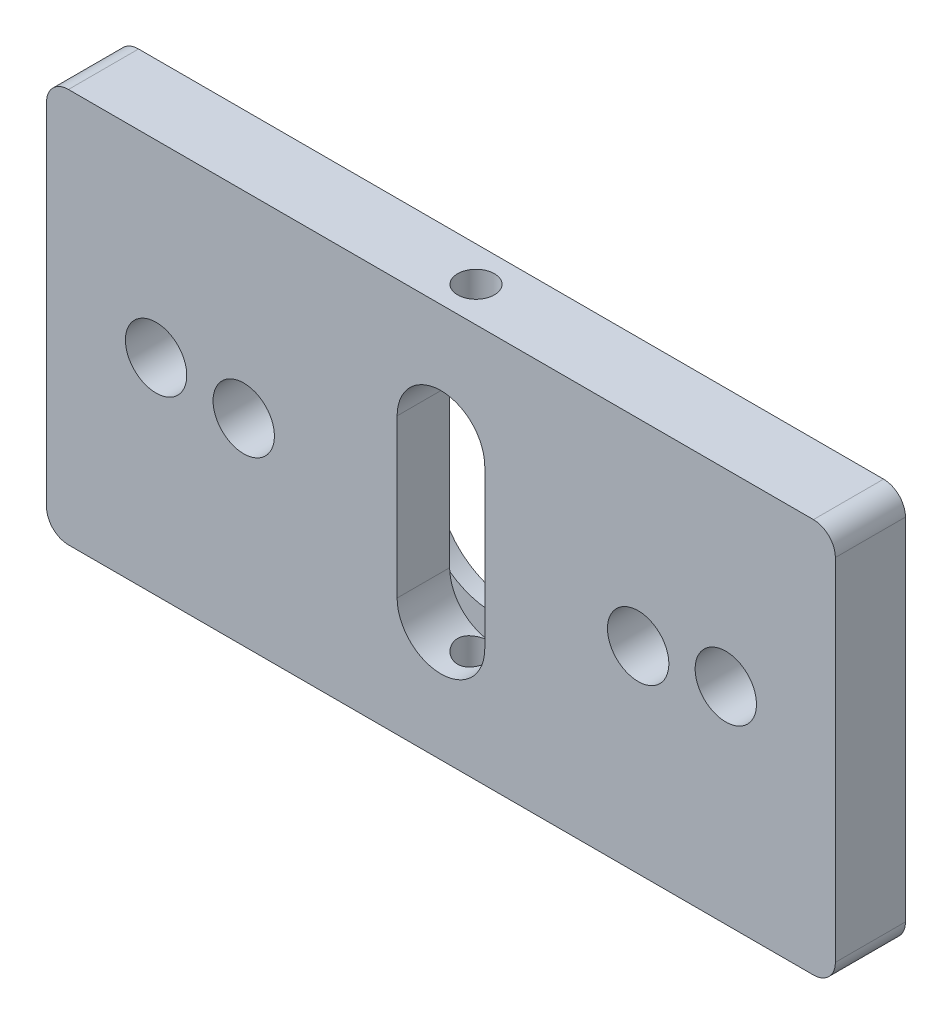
ISO-10303-21;
HEADER;
FILE_DESCRIPTION(('STEP AP214'),'2;1');
FILE_NAME('part.step','',(''),(''),'','','');
FILE_SCHEMA(('AUTOMOTIVE_DESIGN { 1 0 10303 214 1 1 1 1 }'));
ENDSEC;
DATA;
#1=APPLICATION_CONTEXT('core data for automotive mechanical design processes');
#2=APPLICATION_PROTOCOL_DEFINITION('international standard','automotive_design',2000,#1);
#3=PRODUCT_CONTEXT('',#1,'mechanical');
#4=PRODUCT('Part','Part','',(#3));
#5=PRODUCT_RELATED_PRODUCT_CATEGORY('part','',(#4));
#6=PRODUCT_DEFINITION_FORMATION('','',#4);
#7=PRODUCT_DEFINITION_CONTEXT('part definition',#1,'design');
#8=PRODUCT_DEFINITION('design','',#6,#7);
#9=PRODUCT_DEFINITION_SHAPE('','',#8);
#10=(LENGTH_UNIT() NAMED_UNIT(*) SI_UNIT(.MILLI.,.METRE.));
#11=(NAMED_UNIT(*) PLANE_ANGLE_UNIT() SI_UNIT($,.RADIAN.));
#12=(NAMED_UNIT(*) SI_UNIT($,.STERADIAN.) SOLID_ANGLE_UNIT());
#13=UNCERTAINTY_MEASURE_WITH_UNIT(LENGTH_MEASURE(1.E-05),#10,'distance_accuracy_value','');
#14=(GEOMETRIC_REPRESENTATION_CONTEXT(3) GLOBAL_UNCERTAINTY_ASSIGNED_CONTEXT((#13)) GLOBAL_UNIT_ASSIGNED_CONTEXT((#10,
#11,#12)) REPRESENTATION_CONTEXT('',''));
#15=CARTESIAN_POINT('',(0.,0.,0.));
#16=DIRECTION('',(0.,0.,1.));
#17=DIRECTION('',(1.,0.,0.));
#18=AXIS2_PLACEMENT_3D('',#15,#16,#17);
#19=CARTESIAN_POINT('',(0.,0.,0.));
#20=DIRECTION('',(0.,0.,1.));
#21=DIRECTION('',(1.,0.,0.));
#22=AXIS2_PLACEMENT_3D('',#19,#20,#21);
#23=PLANE('',#22);
#24=CARTESIAN_POINT('',(-22.5,0.,0.));
#25=DIRECTION('',(0.,0.,-1.));
#26=DIRECTION('',(-1.,0.,0.));
#27=AXIS2_PLACEMENT_3D('',#24,#25,#26);
#28=CIRCLE('',#27,3.49999999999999);
#29=CARTESIAN_POINT('',(-26.,0.,0.));
#30=VERTEX_POINT('',#29);
#31=EDGE_CURVE('E475',#30,#30,#28,.T.);
#32=ORIENTED_EDGE('',*,*,#31,.F.);
#33=EDGE_LOOP('',(#32));
#34=FACE_BOUND('',#33,.T.);
#35=CARTESIAN_POINT('',(32.5,1.,0.));
#36=DIRECTION('',(0.,0.,-1.));
#37=DIRECTION('',(-1.,0.,0.));
#38=AXIS2_PLACEMENT_3D('',#35,#36,#37);
#39=CIRCLE('',#38,3.49999999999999);
#40=CARTESIAN_POINT('',(29.,1.,0.));
#41=VERTEX_POINT('',#40);
#42=EDGE_CURVE('E463',#41,#41,#39,.T.);
#43=ORIENTED_EDGE('',*,*,#42,.F.);
#44=EDGE_LOOP('',(#43));
#45=FACE_BOUND('',#44,.T.);
#46=CARTESIAN_POINT('',(0.,-2.5,0.));
#47=DIRECTION('',(0.,0.,1.));
#48=DIRECTION('',(1.,0.,0.));
#49=AXIS2_PLACEMENT_3D('',#46,#47,#48);
#50=CIRCLE('',#49,8.5);
#51=CARTESIAN_POINT('',(8.5,-2.5,0.));
#52=VERTEX_POINT('',#51);
#53=CARTESIAN_POINT('',(-8.5,-2.5,0.));
#54=VERTEX_POINT('',#53);
#55=EDGE_CURVE('E249',#52,#54,#50,.F.);
#56=ORIENTED_EDGE('',*,*,#55,.F.);
#57=DIRECTION('',(0.,1.,0.));
#58=VECTOR('',#57,1.);
#59=CARTESIAN_POINT('',(8.5,0.,0.));
#60=LINE('',#59,#58);
#61=CARTESIAN_POINT('',(8.5,2.5,0.));
#62=VERTEX_POINT('',#61);
#63=EDGE_CURVE('E251',#62,#52,#60,.F.);
#64=ORIENTED_EDGE('',*,*,#63,.F.);
#65=CARTESIAN_POINT('',(0.,2.5,0.));
#66=DIRECTION('',(0.,0.,1.));
#67=DIRECTION('',(1.,0.,0.));
#68=AXIS2_PLACEMENT_3D('',#65,#66,#67);
#69=CIRCLE('',#68,8.5);
#70=CARTESIAN_POINT('',(-8.5,2.5,0.));
#71=VERTEX_POINT('',#70);
#72=EDGE_CURVE('E252',#71,#62,#69,.F.);
#73=ORIENTED_EDGE('',*,*,#72,.F.);
#74=DIRECTION('',(0.,1.,0.));
#75=VECTOR('',#74,1.);
#76=CARTESIAN_POINT('',(-8.5,0.,0.));
#77=LINE('',#76,#75);
#78=EDGE_CURVE('E248',#54,#71,#77,.T.);
#79=ORIENTED_EDGE('',*,*,#78,.F.);
#80=EDGE_LOOP('',(#56,#64,#73,#79));
#81=FACE_BOUND('',#80,.T.);
#82=DIRECTION('',(0.,1.,0.));
#83=VECTOR('',#82,1.);
#84=CARTESIAN_POINT('',(-45.,-22.5,0.));
#85=LINE('',#84,#83);
#86=CARTESIAN_POINT('',(-45.,20.,0.));
#87=VERTEX_POINT('',#86);
#88=CARTESIAN_POINT('',(-45.,-20.,0.));
#89=VERTEX_POINT('',#88);
#90=EDGE_CURVE('E376',#87,#89,#85,.F.);
#91=ORIENTED_EDGE('',*,*,#90,.F.);
#92=CARTESIAN_POINT('',(-42.5,20.,0.));
#93=DIRECTION('',(0.,0.,1.));
#94=DIRECTION('',(1.,0.,0.));
#95=AXIS2_PLACEMENT_3D('',#92,#93,#94);
#96=CIRCLE('',#95,2.5);
#97=CARTESIAN_POINT('',(-42.5,22.5,0.));
#98=VERTEX_POINT('',#97);
#99=EDGE_CURVE('E233',#98,#87,#96,.T.);
#100=ORIENTED_EDGE('',*,*,#99,.F.);
#101=DIRECTION('',(1.,0.,0.));
#102=VECTOR('',#101,1.);
#103=CARTESIAN_POINT('',(-45.,22.5,0.));
#104=LINE('',#103,#102);
#105=CARTESIAN_POINT('',(42.5,22.5,0.));
#106=VERTEX_POINT('',#105);
#107=EDGE_CURVE('E397',#106,#98,#104,.F.);
#108=ORIENTED_EDGE('',*,*,#107,.F.);
#109=CARTESIAN_POINT('',(42.5,20.,0.));
#110=DIRECTION('',(0.,0.,1.));
#111=DIRECTION('',(1.,0.,0.));
#112=AXIS2_PLACEMENT_3D('',#109,#110,#111);
#113=CIRCLE('',#112,2.5);
#114=CARTESIAN_POINT('',(45.,20.,0.));
#115=VERTEX_POINT('',#114);
#116=EDGE_CURVE('E237',#115,#106,#113,.T.);
#117=ORIENTED_EDGE('',*,*,#116,.F.);
#118=DIRECTION('',(0.,1.,0.));
#119=VECTOR('',#118,1.);
#120=CARTESIAN_POINT('',(45.,22.5,0.));
#121=LINE('',#120,#119);
#122=CARTESIAN_POINT('',(45.,-20.,0.));
#123=VERTEX_POINT('',#122);
#124=EDGE_CURVE('E402',#123,#115,#121,.T.);
#125=ORIENTED_EDGE('',*,*,#124,.F.);
#126=CARTESIAN_POINT('',(42.5,-20.,0.));
#127=DIRECTION('',(0.,0.,1.));
#128=DIRECTION('',(1.,0.,0.));
#129=AXIS2_PLACEMENT_3D('',#126,#127,#128);
#130=CIRCLE('',#129,2.5);
#131=CARTESIAN_POINT('',(42.5,-22.5,0.));
#132=VERTEX_POINT('',#131);
#133=EDGE_CURVE('E241',#132,#123,#130,.T.);
#134=ORIENTED_EDGE('',*,*,#133,.F.);
#135=DIRECTION('',(1.,0.,0.));
#136=VECTOR('',#135,1.);
#137=CARTESIAN_POINT('',(45.,-22.5,0.));
#138=LINE('',#137,#136);
#139=CARTESIAN_POINT('',(-42.5,-22.5,0.));
#140=VERTEX_POINT('',#139);
#141=EDGE_CURVE('E407',#140,#132,#138,.T.);
#142=ORIENTED_EDGE('',*,*,#141,.F.);
#143=CARTESIAN_POINT('',(-42.5,-20.,0.));
#144=DIRECTION('',(0.,0.,1.));
#145=DIRECTION('',(1.,0.,0.));
#146=AXIS2_PLACEMENT_3D('',#143,#144,#145);
#147=CIRCLE('',#146,2.5);
#148=EDGE_CURVE('E245',#89,#140,#147,.T.);
#149=ORIENTED_EDGE('',*,*,#148,.F.);
#150=EDGE_LOOP('',(#91,#100,#108,#117,#125,#134,#142,#149));
#151=FACE_BOUND('',#150,.T.);
#152=CARTESIAN_POINT('',(22.5,0.,0.));
#153=DIRECTION('',(0.,0.,-1.));
#154=DIRECTION('',(-1.,0.,0.));
#155=AXIS2_PLACEMENT_3D('',#152,#153,#154);
#156=CIRCLE('',#155,3.49999999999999);
#157=CARTESIAN_POINT('',(19.,0.,0.));
#158=VERTEX_POINT('',#157);
#159=EDGE_CURVE('E469',#158,#158,#156,.T.);
#160=ORIENTED_EDGE('',*,*,#159,.F.);
#161=EDGE_LOOP('',(#160));
#162=FACE_BOUND('',#161,.T.);
#163=CARTESIAN_POINT('',(-32.5,0.999999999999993,0.));
#164=DIRECTION('',(0.,0.,-1.));
#165=DIRECTION('',(-1.,0.,0.));
#166=AXIS2_PLACEMENT_3D('',#163,#164,#165);
#167=CIRCLE('',#166,3.49999999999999);
#168=CARTESIAN_POINT('',(-36.,0.999999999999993,0.));
#169=VERTEX_POINT('',#168);
#170=EDGE_CURVE('E309',#169,#169,#167,.T.);
#171=ORIENTED_EDGE('',*,*,#170,.F.);
#172=EDGE_LOOP('',(#171));
#173=FACE_BOUND('',#172,.T.);
#174=ADVANCED_FACE('F40',(#34,#45,#81,#151,#162,#173),#23,.F.);
#175=CARTESIAN_POINT('',(0.,0.,8.));
#176=DIRECTION('',(0.,0.,1.));
#177=DIRECTION('',(1.,0.,0.));
#178=AXIS2_PLACEMENT_3D('',#175,#176,#177);
#179=PLANE('',#178);
#180=CARTESIAN_POINT('',(-22.5,0.,8.));
#181=DIRECTION('',(0.,0.,-1.));
#182=DIRECTION('',(-1.,0.,0.));
#183=AXIS2_PLACEMENT_3D('',#180,#181,#182);
#184=CIRCLE('',#183,3.5);
#185=CARTESIAN_POINT('',(-26.,0.,8.));
#186=VERTEX_POINT('',#185);
#187=EDGE_CURVE('E472',#186,#186,#184,.T.);
#188=ORIENTED_EDGE('',*,*,#187,.T.);
#189=EDGE_LOOP('',(#188));
#190=FACE_BOUND('',#189,.T.);
#191=CARTESIAN_POINT('',(32.5,1.,8.));
#192=DIRECTION('',(0.,0.,-1.));
#193=DIRECTION('',(-1.,0.,0.));
#194=AXIS2_PLACEMENT_3D('',#191,#192,#193);
#195=CIRCLE('',#194,3.5);
#196=CARTESIAN_POINT('',(29.,1.,8.));
#197=VERTEX_POINT('',#196);
#198=EDGE_CURVE('E429',#197,#197,#195,.T.);
#199=ORIENTED_EDGE('',*,*,#198,.T.);
#200=EDGE_LOOP('',(#199));
#201=FACE_BOUND('',#200,.T.);
#202=DIRECTION('',(0.,1.,0.));
#203=VECTOR('',#202,1.);
#204=CARTESIAN_POINT('',(-5.,0.,8.));
#205=LINE('',#204,#203);
#206=CARTESIAN_POINT('',(-5.,-9.,8.));
#207=VERTEX_POINT('',#206);
#208=CARTESIAN_POINT('',(-5.,9.,8.));
#209=VERTEX_POINT('',#208);
#210=EDGE_CURVE('E431',#207,#209,#205,.T.);
#211=ORIENTED_EDGE('',*,*,#210,.T.);
#212=CARTESIAN_POINT('',(0.,9.,8.));
#213=DIRECTION('',(0.,0.,-1.));
#214=DIRECTION('',(-1.,0.,0.));
#215=AXIS2_PLACEMENT_3D('',#212,#213,#214);
#216=CIRCLE('',#215,5.);
#217=CARTESIAN_POINT('',(5.,9.,8.));
#218=VERTEX_POINT('',#217);
#219=EDGE_CURVE('E286',#209,#218,#216,.T.);
#220=ORIENTED_EDGE('',*,*,#219,.T.);
#221=DIRECTION('',(0.,1.,0.));
#222=VECTOR('',#221,1.);
#223=CARTESIAN_POINT('',(5.,0.,8.));
#224=LINE('',#223,#222);
#225=CARTESIAN_POINT('',(5.,-9.,8.));
#226=VERTEX_POINT('',#225);
#227=EDGE_CURVE('E381',#218,#226,#224,.F.);
#228=ORIENTED_EDGE('',*,*,#227,.T.);
#229=CARTESIAN_POINT('',(0.,-9.,8.));
#230=DIRECTION('',(0.,0.,-1.));
#231=DIRECTION('',(-1.,0.,0.));
#232=AXIS2_PLACEMENT_3D('',#229,#230,#231);
#233=CIRCLE('',#232,5.);
#234=EDGE_CURVE('E432',#226,#207,#233,.T.);
#235=ORIENTED_EDGE('',*,*,#234,.T.);
#236=EDGE_LOOP('',(#211,#220,#228,#235));
#237=FACE_BOUND('',#236,.T.);
#238=CARTESIAN_POINT('',(-42.5,20.,8.));
#239=DIRECTION('',(0.,0.,1.));
#240=DIRECTION('',(1.,0.,0.));
#241=AXIS2_PLACEMENT_3D('',#238,#239,#240);
#242=CIRCLE('',#241,2.5);
#243=CARTESIAN_POINT('',(-42.5,22.5,8.));
#244=VERTEX_POINT('',#243);
#245=CARTESIAN_POINT('',(-45.,20.,8.));
#246=VERTEX_POINT('',#245);
#247=EDGE_CURVE('E435',#244,#246,#242,.T.);
#248=ORIENTED_EDGE('',*,*,#247,.T.);
#249=DIRECTION('',(0.,1.,0.));
#250=VECTOR('',#249,1.);
#251=CARTESIAN_POINT('',(-45.,0.,8.));
#252=LINE('',#251,#250);
#253=CARTESIAN_POINT('',(-45.,-20.,8.));
#254=VERTEX_POINT('',#253);
#255=EDGE_CURVE('E438',#246,#254,#252,.F.);
#256=ORIENTED_EDGE('',*,*,#255,.T.);
#257=CARTESIAN_POINT('',(-42.5,-20.,8.));
#258=DIRECTION('',(0.,0.,1.));
#259=DIRECTION('',(1.,0.,0.));
#260=AXIS2_PLACEMENT_3D('',#257,#258,#259);
#261=CIRCLE('',#260,2.5);
#262=CARTESIAN_POINT('',(-42.5,-22.5,8.));
#263=VERTEX_POINT('',#262);
#264=EDGE_CURVE('E385',#254,#263,#261,.T.);
#265=ORIENTED_EDGE('',*,*,#264,.T.);
#266=DIRECTION('',(1.,0.,0.));
#267=VECTOR('',#266,1.);
#268=CARTESIAN_POINT('',(0.,-22.5,8.));
#269=LINE('',#268,#267);
#270=CARTESIAN_POINT('',(42.5,-22.5,8.));
#271=VERTEX_POINT('',#270);
#272=EDGE_CURVE('E446',#263,#271,#269,.T.);
#273=ORIENTED_EDGE('',*,*,#272,.T.);
#274=CARTESIAN_POINT('',(42.5,-20.,8.));
#275=DIRECTION('',(0.,0.,1.));
#276=DIRECTION('',(1.,0.,0.));
#277=AXIS2_PLACEMENT_3D('',#274,#275,#276);
#278=CIRCLE('',#277,2.5);
#279=CARTESIAN_POINT('',(45.,-20.,8.));
#280=VERTEX_POINT('',#279);
#281=EDGE_CURVE('E444',#271,#280,#278,.T.);
#282=ORIENTED_EDGE('',*,*,#281,.T.);
#283=DIRECTION('',(0.,1.,0.));
#284=VECTOR('',#283,1.);
#285=CARTESIAN_POINT('',(45.,0.,8.));
#286=LINE('',#285,#284);
#287=CARTESIAN_POINT('',(45.,20.,8.));
#288=VERTEX_POINT('',#287);
#289=EDGE_CURVE('E443',#280,#288,#286,.T.);
#290=ORIENTED_EDGE('',*,*,#289,.T.);
#291=CARTESIAN_POINT('',(42.5,20.,8.));
#292=DIRECTION('',(0.,0.,1.));
#293=DIRECTION('',(1.,0.,0.));
#294=AXIS2_PLACEMENT_3D('',#291,#292,#293);
#295=CIRCLE('',#294,2.5);
#296=CARTESIAN_POINT('',(42.5,22.5,8.));
#297=VERTEX_POINT('',#296);
#298=EDGE_CURVE('E440',#288,#297,#295,.T.);
#299=ORIENTED_EDGE('',*,*,#298,.T.);
#300=DIRECTION('',(1.,0.,0.));
#301=VECTOR('',#300,1.);
#302=CARTESIAN_POINT('',(0.,22.5,8.));
#303=LINE('',#302,#301);
#304=EDGE_CURVE('E439',#297,#244,#303,.F.);
#305=ORIENTED_EDGE('',*,*,#304,.T.);
#306=EDGE_LOOP('',(#248,#256,#265,#273,#282,#290,#299,#305));
#307=FACE_BOUND('',#306,.T.);
#308=CARTESIAN_POINT('',(22.5,0.,8.));
#309=DIRECTION('',(0.,0.,-1.));
#310=DIRECTION('',(-1.,0.,0.));
#311=AXIS2_PLACEMENT_3D('',#308,#309,#310);
#312=CIRCLE('',#311,3.5);
#313=CARTESIAN_POINT('',(19.,0.,8.));
#314=VERTEX_POINT('',#313);
#315=EDGE_CURVE('E466',#314,#314,#312,.T.);
#316=ORIENTED_EDGE('',*,*,#315,.T.);
#317=EDGE_LOOP('',(#316));
#318=FACE_BOUND('',#317,.T.);
#319=CARTESIAN_POINT('',(-32.5,0.999999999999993,8.));
#320=DIRECTION('',(0.,0.,-1.));
#321=DIRECTION('',(-1.,0.,0.));
#322=AXIS2_PLACEMENT_3D('',#319,#320,#321);
#323=CIRCLE('',#322,3.5);
#324=CARTESIAN_POINT('',(-36.,0.999999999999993,8.));
#325=VERTEX_POINT('',#324);
#326=EDGE_CURVE('E477',#325,#325,#323,.T.);
#327=ORIENTED_EDGE('',*,*,#326,.T.);
#328=EDGE_LOOP('',(#327));
#329=FACE_BOUND('',#328,.T.);
#330=ADVANCED_FACE('F326',(#190,#201,#237,#307,#318,#329),#179,.T.);
#331=CARTESIAN_POINT('',(0.,2.5,0.));
#332=DIRECTION('',(0.,0.,1.));
#333=DIRECTION('',(1.,0.,0.));
#334=AXIS2_PLACEMENT_3D('',#331,#332,#333);
#335=CYLINDRICAL_SURFACE('',#334,8.5);
#336=CARTESIAN_POINT('',(0.,2.5,2.));
#337=DIRECTION('',(0.,0.,1.));
#338=DIRECTION('',(1.,0.,0.));
#339=AXIS2_PLACEMENT_3D('',#336,#337,#338);
#340=CIRCLE('',#339,8.5);
#341=CARTESIAN_POINT('',(0.640312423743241,10.9758480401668,2.));
#342=VERTEX_POINT('',#341);
#343=CARTESIAN_POINT('',(4.98518515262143,9.38461538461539,2.));
#344=VERTEX_POINT('',#343);
#345=EDGE_CURVE('E254',#342,#344,#340,.F.);
#346=ORIENTED_EDGE('',*,*,#345,.F.);
#347=CARTESIAN_POINT('',(0.640312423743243,10.9758480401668,2.));
#348=CARTESIAN_POINT('',(0.58490483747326,10.9800365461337,1.98226057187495));
#349=CARTESIAN_POINT('',(0.5287496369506,10.9837289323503,1.96682265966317));
#350=CARTESIAN_POINT('',(0.415290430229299,10.9900387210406,1.94064898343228));
#351=CARTESIAN_POINT('',(0.357986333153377,10.992656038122,1.92991359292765));
#352=CARTESIAN_POINT('',(0.188006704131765,10.9986600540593,1.90536460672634));
#353=CARTESIAN_POINT('',(0.0742256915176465,11.0004328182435,1.89824420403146));
#354=CARTESIAN_POINT('',(-0.1401411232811,10.9994439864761,1.90225406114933));
#355=CARTESIAN_POINT('',(-0.240772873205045,10.9971695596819,1.91142329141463));
#356=CARTESIAN_POINT('',(-0.390986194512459,10.991156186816,1.93607348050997));
#357=CARTESIAN_POINT('',(-0.441527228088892,10.9886726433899,1.94629454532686));
#358=CARTESIAN_POINT('',(-0.54168004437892,10.982871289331,1.97040979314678));
#359=CARTESIAN_POINT('',(-0.59129176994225,10.9795534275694,1.98430420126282));
#360=CARTESIAN_POINT('',(-0.640312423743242,10.9758480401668,2.));
#361=B_SPLINE_CURVE_WITH_KNOTS('',3,(#347,#348,#349,#350,#351,#352,#353,#354,#355,#356,#357,
#358,#359,#360),.UNSPECIFIED.,.F.,.F.,(4,2,2,2,2,2,4),(0.,0.174881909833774,0.349777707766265,
0.690103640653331,0.992184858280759,1.14692620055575,1.30167702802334),.UNSPECIFIED.);
#362=CARTESIAN_POINT('',(-0.64031242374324,10.9758480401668,2.));
#363=VERTEX_POINT('',#362);
#364=EDGE_CURVE('E206',#342,#363,#361,.T.);
#365=ORIENTED_EDGE('',*,*,#364,.T.);
#366=CARTESIAN_POINT('',(0.,2.5,2.));
#367=DIRECTION('',(0.,0.,1.));
#368=DIRECTION('',(1.,0.,0.));
#369=AXIS2_PLACEMENT_3D('',#366,#367,#368);
#370=CIRCLE('',#369,8.5);
#371=CARTESIAN_POINT('',(-4.98518515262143,9.38461538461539,2.));
#372=VERTEX_POINT('',#371);
#373=EDGE_CURVE('E205',#372,#363,#370,.F.);
#374=ORIENTED_EDGE('',*,*,#373,.F.);
#375=CARTESIAN_POINT('',(0.,2.5,2.));
#376=DIRECTION('',(0.,0.,1.));
#377=DIRECTION('',(1.,0.,0.));
#378=AXIS2_PLACEMENT_3D('',#375,#376,#377);
#379=CIRCLE('',#378,8.5);
#380=CARTESIAN_POINT('',(-8.5,2.5,2.));
#381=VERTEX_POINT('',#380);
#382=EDGE_CURVE('E261',#372,#381,#379,.T.);
#383=ORIENTED_EDGE('',*,*,#382,.T.);
#384=DIRECTION('',(0.,0.,1.));
#385=VECTOR('',#384,1.);
#386=CARTESIAN_POINT('',(-8.5,2.5,0.));
#387=LINE('',#386,#385);
#388=EDGE_CURVE('E423',#381,#71,#387,.F.);
#389=ORIENTED_EDGE('',*,*,#388,.T.);
#390=ORIENTED_EDGE('',*,*,#72,.T.);
#391=DIRECTION('',(0.,0.,-1.));
#392=VECTOR('',#391,1.);
#393=CARTESIAN_POINT('',(8.5,2.5,0.));
#394=LINE('',#393,#392);
#395=CARTESIAN_POINT('',(8.5,2.5,2.));
#396=VERTEX_POINT('',#395);
#397=EDGE_CURVE('E427',#62,#396,#394,.F.);
#398=ORIENTED_EDGE('',*,*,#397,.T.);
#399=CARTESIAN_POINT('',(0.,2.5,2.));
#400=DIRECTION('',(0.,0.,1.));
#401=DIRECTION('',(1.,0.,0.));
#402=AXIS2_PLACEMENT_3D('',#399,#400,#401);
#403=CIRCLE('',#402,8.5);
#404=EDGE_CURVE('E274',#396,#344,#403,.T.);
#405=ORIENTED_EDGE('',*,*,#404,.T.);
#406=EDGE_LOOP('',(#346,#365,#374,#383,#389,#390,#398,#405));
#407=FACE_BOUND('',#406,.T.);
#408=ADVANCED_FACE('F42',(#407),#335,.F.);
#409=CARTESIAN_POINT('',(8.5,2.5,0.));
#410=DIRECTION('',(1.,0.,0.));
#411=DIRECTION('',(0.,0.,-1.));
#412=AXIS2_PLACEMENT_3D('',#409,#410,#411);
#413=PLANE('',#412);
#414=ORIENTED_EDGE('',*,*,#397,.F.);
#415=ORIENTED_EDGE('',*,*,#63,.T.);
#416=DIRECTION('',(0.,0.,1.));
#417=VECTOR('',#416,1.);
#418=CARTESIAN_POINT('',(8.5,-2.5,0.));
#419=LINE('',#418,#417);
#420=CARTESIAN_POINT('',(8.5,-2.5,2.));
#421=VERTEX_POINT('',#420);
#422=EDGE_CURVE('E425',#52,#421,#419,.T.);
#423=ORIENTED_EDGE('',*,*,#422,.T.);
#424=DIRECTION('',(0.,1.,0.));
#425=VECTOR('',#424,1.);
#426=CARTESIAN_POINT('',(8.5,0.,2.));
#427=LINE('',#426,#425);
#428=EDGE_CURVE('E277',#421,#396,#427,.T.);
#429=ORIENTED_EDGE('',*,*,#428,.T.);
#430=EDGE_LOOP('',(#414,#415,#423,#429));
#431=FACE_BOUND('',#430,.T.);
#432=ADVANCED_FACE('F318',(#431),#413,.F.);
#433=CARTESIAN_POINT('',(0.,-2.5,0.));
#434=DIRECTION('',(0.,0.,1.));
#435=DIRECTION('',(1.,0.,0.));
#436=AXIS2_PLACEMENT_3D('',#433,#434,#435);
#437=CYLINDRICAL_SURFACE('',#436,8.5);
#438=CARTESIAN_POINT('',(0.,-2.5,2.));
#439=DIRECTION('',(0.,0.,1.));
#440=DIRECTION('',(1.,0.,0.));
#441=AXIS2_PLACEMENT_3D('',#438,#439,#440);
#442=CIRCLE('',#441,8.5);
#443=CARTESIAN_POINT('',(-0.640312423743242,-10.9758480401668,2.));
#444=VERTEX_POINT('',#443);
#445=CARTESIAN_POINT('',(-4.98518515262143,-9.38461538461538,2.));
#446=VERTEX_POINT('',#445);
#447=EDGE_CURVE('E264',#444,#446,#442,.F.);
#448=ORIENTED_EDGE('',*,*,#447,.F.);
#449=CARTESIAN_POINT('',(-0.640312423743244,-10.9758480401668,2.));
#450=CARTESIAN_POINT('',(-0.584904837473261,-10.9800365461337,1.98226057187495));
#451=CARTESIAN_POINT('',(-0.528749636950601,-10.9837289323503,1.96682265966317));
#452=CARTESIAN_POINT('',(-0.4152904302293,-10.9900387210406,1.94064898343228));
#453=CARTESIAN_POINT('',(-0.357986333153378,-10.992656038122,1.92991359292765));
#454=CARTESIAN_POINT('',(-0.188006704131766,-10.9986600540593,1.90536460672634));
#455=CARTESIAN_POINT('',(-0.0742256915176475,-11.0004328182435,1.89824420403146));
#456=CARTESIAN_POINT('',(0.140141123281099,-10.9994439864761,1.90225406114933));
#457=CARTESIAN_POINT('',(0.240772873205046,-10.9971695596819,1.91142329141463));
#458=CARTESIAN_POINT('',(0.39098619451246,-10.991156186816,1.93607348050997));
#459=CARTESIAN_POINT('',(0.441527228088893,-10.9886726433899,1.94629454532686));
#460=CARTESIAN_POINT('',(0.541680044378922,-10.982871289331,1.97040979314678));
#461=CARTESIAN_POINT('',(0.591291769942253,-10.9795534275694,1.98430420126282));
#462=CARTESIAN_POINT('',(0.640312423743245,-10.9758480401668,2.));
#463=B_SPLINE_CURVE_WITH_KNOTS('',3,(#449,#450,#451,#452,#453,#454,#455,#456,#457,#458,#459,
#460,#461,#462),.UNSPECIFIED.,.F.,.F.,(4,2,2,2,2,2,4),(0.,0.174881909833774,0.349777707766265,
0.690103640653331,0.992184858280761,1.14692620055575,1.30167702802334),.UNSPECIFIED.);
#464=CARTESIAN_POINT('',(0.640312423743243,-10.9758480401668,2.));
#465=VERTEX_POINT('',#464);
#466=EDGE_CURVE('E301',#444,#465,#463,.T.);
#467=ORIENTED_EDGE('',*,*,#466,.T.);
#468=CARTESIAN_POINT('',(0.,-2.5,2.));
#469=DIRECTION('',(0.,0.,1.));
#470=DIRECTION('',(1.,0.,0.));
#471=AXIS2_PLACEMENT_3D('',#468,#469,#470);
#472=CIRCLE('',#471,8.5);
#473=CARTESIAN_POINT('',(4.98518515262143,-9.38461538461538,2.));
#474=VERTEX_POINT('',#473);
#475=EDGE_CURVE('E266',#474,#465,#472,.F.);
#476=ORIENTED_EDGE('',*,*,#475,.F.);
#477=CARTESIAN_POINT('',(0.,-2.5,2.));
#478=DIRECTION('',(0.,0.,1.));
#479=DIRECTION('',(1.,0.,0.));
#480=AXIS2_PLACEMENT_3D('',#477,#478,#479);
#481=CIRCLE('',#480,8.5);
#482=EDGE_CURVE('E278',#474,#421,#481,.T.);
#483=ORIENTED_EDGE('',*,*,#482,.T.);
#484=ORIENTED_EDGE('',*,*,#422,.F.);
#485=ORIENTED_EDGE('',*,*,#55,.T.);
#486=DIRECTION('',(0.,0.,1.));
#487=VECTOR('',#486,1.);
#488=CARTESIAN_POINT('',(-8.5,-2.5,0.));
#489=LINE('',#488,#487);
#490=CARTESIAN_POINT('',(-8.5,-2.5,2.));
#491=VERTEX_POINT('',#490);
#492=EDGE_CURVE('E280',#54,#491,#489,.T.);
#493=ORIENTED_EDGE('',*,*,#492,.T.);
#494=CARTESIAN_POINT('',(0.,-2.5,2.));
#495=DIRECTION('',(0.,0.,1.));
#496=DIRECTION('',(1.,0.,0.));
#497=AXIS2_PLACEMENT_3D('',#494,#495,#496);
#498=CIRCLE('',#497,8.5);
#499=EDGE_CURVE('E257',#491,#446,#498,.T.);
#500=ORIENTED_EDGE('',*,*,#499,.T.);
#501=EDGE_LOOP('',(#448,#467,#476,#483,#484,#485,#493,#500));
#502=FACE_BOUND('',#501,.T.);
#503=ADVANCED_FACE('F313',(#502),#437,.F.);
#504=CARTESIAN_POINT('',(-8.5,-2.5,0.));
#505=DIRECTION('',(-1.,0.,0.));
#506=DIRECTION('',(0.,0.,1.));
#507=AXIS2_PLACEMENT_3D('',#504,#505,#506);
#508=PLANE('',#507);
#509=ORIENTED_EDGE('',*,*,#492,.F.);
#510=ORIENTED_EDGE('',*,*,#78,.T.);
#511=ORIENTED_EDGE('',*,*,#388,.F.);
#512=DIRECTION('',(0.,1.,0.));
#513=VECTOR('',#512,1.);
#514=CARTESIAN_POINT('',(-8.5,0.,2.));
#515=LINE('',#514,#513);
#516=EDGE_CURVE('E260',#381,#491,#515,.F.);
#517=ORIENTED_EDGE('',*,*,#516,.T.);
#518=EDGE_LOOP('',(#509,#510,#511,#517));
#519=FACE_BOUND('',#518,.T.);
#520=ADVANCED_FACE('F317',(#519),#508,.F.);
#521=CARTESIAN_POINT('',(0.,0.,2.));
#522=DIRECTION('',(0.,0.,1.));
#523=DIRECTION('',(1.,0.,0.));
#524=AXIS2_PLACEMENT_3D('',#521,#522,#523);
#525=PLANE('',#524);
#526=DIRECTION('',(0.,1.,0.));
#527=VECTOR('',#526,1.);
#528=CARTESIAN_POINT('',(5.,-9.,2.));
#529=LINE('',#528,#527);
#530=CARTESIAN_POINT('',(5.,-9.,2.));
#531=VERTEX_POINT('',#530);
#532=CARTESIAN_POINT('',(5.,9.,2.));
#533=VERTEX_POINT('',#532);
#534=EDGE_CURVE('E232',#531,#533,#529,.T.);
#535=ORIENTED_EDGE('',*,*,#534,.T.);
#536=CARTESIAN_POINT('',(0.,9.,2.));
#537=DIRECTION('',(0.,0.,-1.));
#538=DIRECTION('',(-1.,0.,0.));
#539=AXIS2_PLACEMENT_3D('',#536,#537,#538);
#540=CIRCLE('',#539,5.);
#541=EDGE_CURVE('E272',#344,#533,#540,.T.);
#542=ORIENTED_EDGE('',*,*,#541,.F.);
#543=ORIENTED_EDGE('',*,*,#404,.F.);
#544=ORIENTED_EDGE('',*,*,#428,.F.);
#545=ORIENTED_EDGE('',*,*,#482,.F.);
#546=CARTESIAN_POINT('',(0.,-9.,2.));
#547=DIRECTION('',(0.,0.,-1.));
#548=DIRECTION('',(-1.,0.,0.));
#549=AXIS2_PLACEMENT_3D('',#546,#547,#548);
#550=CIRCLE('',#549,5.);
#551=EDGE_CURVE('E269',#531,#474,#550,.T.);
#552=ORIENTED_EDGE('',*,*,#551,.F.);
#553=EDGE_LOOP('',(#535,#542,#543,#544,#545,#552));
#554=FACE_BOUND('',#553,.T.);
#555=ADVANCED_FACE('F360',(#554),#525,.F.);
#556=CARTESIAN_POINT('',(0.,0.,2.));
#557=DIRECTION('',(0.,0.,1.));
#558=DIRECTION('',(1.,0.,0.));
#559=AXIS2_PLACEMENT_3D('',#556,#557,#558);
#560=PLANE('',#559);
#561=DIRECTION('',(0.,-1.,0.));
#562=VECTOR('',#561,1.);
#563=CARTESIAN_POINT('',(0.640312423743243,-22.5,2.));
#564=LINE('',#563,#562);
#565=CARTESIAN_POINT('',(0.64031242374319,-13.958830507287,1.99999999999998));
#566=VERTEX_POINT('',#565);
#567=EDGE_CURVE('E310',#566,#465,#564,.F.);
#568=ORIENTED_EDGE('',*,*,#567,.F.);
#569=CARTESIAN_POINT('',(0.,-9.,2.));
#570=DIRECTION('',(0.,0.,-1.));
#571=DIRECTION('',(-1.,0.,0.));
#572=AXIS2_PLACEMENT_3D('',#569,#570,#571);
#573=CIRCLE('',#572,5.);
#574=EDGE_CURVE('E230',#566,#474,#573,.F.);
#575=ORIENTED_EDGE('',*,*,#574,.T.);
#576=ORIENTED_EDGE('',*,*,#475,.T.);
#577=EDGE_LOOP('',(#568,#575,#576));
#578=FACE_BOUND('',#577,.T.);
#579=ADVANCED_FACE('F357',(#578),#560,.T.);
#580=CARTESIAN_POINT('',(0.,0.,2.));
#581=DIRECTION('',(0.,0.,1.));
#582=DIRECTION('',(1.,0.,0.));
#583=AXIS2_PLACEMENT_3D('',#580,#581,#582);
#584=PLANE('',#583);
#585=DIRECTION('',(0.,-1.,0.));
#586=VECTOR('',#585,1.);
#587=CARTESIAN_POINT('',(-0.640312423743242,-22.5,2.));
#588=LINE('',#587,#586);
#589=CARTESIAN_POINT('',(-0.640312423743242,-13.958830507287,2.));
#590=VERTEX_POINT('',#589);
#591=EDGE_CURVE('E68',#444,#590,#588,.T.);
#592=ORIENTED_EDGE('',*,*,#591,.F.);
#593=ORIENTED_EDGE('',*,*,#447,.T.);
#594=CARTESIAN_POINT('',(0.,-9.,2.));
#595=DIRECTION('',(0.,0.,-1.));
#596=DIRECTION('',(-1.,0.,0.));
#597=AXIS2_PLACEMENT_3D('',#594,#595,#596);
#598=CIRCLE('',#597,5.);
#599=EDGE_CURVE('E223',#446,#590,#598,.F.);
#600=ORIENTED_EDGE('',*,*,#599,.T.);
#601=EDGE_LOOP('',(#592,#593,#600));
#602=FACE_BOUND('',#601,.T.);
#603=ADVANCED_FACE('F353',(#602),#584,.T.);
#604=CARTESIAN_POINT('',(0.,0.,2.));
#605=DIRECTION('',(0.,0.,1.));
#606=DIRECTION('',(1.,0.,0.));
#607=AXIS2_PLACEMENT_3D('',#604,#605,#606);
#608=PLANE('',#607);
#609=ORIENTED_EDGE('',*,*,#499,.F.);
#610=ORIENTED_EDGE('',*,*,#516,.F.);
#611=ORIENTED_EDGE('',*,*,#382,.F.);
#612=CARTESIAN_POINT('',(0.,9.,2.));
#613=DIRECTION('',(0.,0.,-1.));
#614=DIRECTION('',(-1.,0.,0.));
#615=AXIS2_PLACEMENT_3D('',#612,#613,#614);
#616=CIRCLE('',#615,5.);
#617=CARTESIAN_POINT('',(-5.,9.,2.));
#618=VERTEX_POINT('',#617);
#619=EDGE_CURVE('E210',#618,#372,#616,.T.);
#620=ORIENTED_EDGE('',*,*,#619,.F.);
#621=DIRECTION('',(0.,1.,0.));
#622=VECTOR('',#621,1.);
#623=CARTESIAN_POINT('',(-5.,9.,2.));
#624=LINE('',#623,#622);
#625=CARTESIAN_POINT('',(-5.,-9.,2.));
#626=VERTEX_POINT('',#625);
#627=EDGE_CURVE('E212',#618,#626,#624,.F.);
#628=ORIENTED_EDGE('',*,*,#627,.T.);
#629=CARTESIAN_POINT('',(0.,-9.,2.));
#630=DIRECTION('',(0.,0.,-1.));
#631=DIRECTION('',(-1.,0.,0.));
#632=AXIS2_PLACEMENT_3D('',#629,#630,#631);
#633=CIRCLE('',#632,5.);
#634=EDGE_CURVE('E226',#626,#446,#633,.F.);
#635=ORIENTED_EDGE('',*,*,#634,.T.);
#636=EDGE_LOOP('',(#609,#610,#611,#620,#628,#635));
#637=FACE_BOUND('',#636,.T.);
#638=ADVANCED_FACE('F350',(#637),#608,.F.);
#639=CARTESIAN_POINT('',(0.,0.,2.));
#640=DIRECTION('',(0.,0.,1.));
#641=DIRECTION('',(1.,0.,0.));
#642=AXIS2_PLACEMENT_3D('',#639,#640,#641);
#643=PLANE('',#642);
#644=DIRECTION('',(0.,1.,0.));
#645=VECTOR('',#644,1.);
#646=CARTESIAN_POINT('',(-0.64031242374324,22.5,2.));
#647=LINE('',#646,#645);
#648=CARTESIAN_POINT('',(-0.64031242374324,13.958830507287,2.));
#649=VERTEX_POINT('',#648);
#650=EDGE_CURVE('E193',#649,#363,#647,.F.);
#651=ORIENTED_EDGE('',*,*,#650,.F.);
#652=CARTESIAN_POINT('',(0.,9.,2.));
#653=DIRECTION('',(0.,0.,-1.));
#654=DIRECTION('',(-1.,0.,0.));
#655=AXIS2_PLACEMENT_3D('',#652,#653,#654);
#656=CIRCLE('',#655,5.);
#657=EDGE_CURVE('E202',#649,#372,#656,.F.);
#658=ORIENTED_EDGE('',*,*,#657,.T.);
#659=ORIENTED_EDGE('',*,*,#373,.T.);
#660=EDGE_LOOP('',(#651,#658,#659));
#661=FACE_BOUND('',#660,.T.);
#662=ADVANCED_FACE('F201',(#661),#643,.T.);
#663=CARTESIAN_POINT('',(0.,0.,2.));
#664=DIRECTION('',(0.,0.,1.));
#665=DIRECTION('',(1.,0.,0.));
#666=AXIS2_PLACEMENT_3D('',#663,#664,#665);
#667=PLANE('',#666);
#668=DIRECTION('',(0.,1.,0.));
#669=VECTOR('',#668,1.);
#670=CARTESIAN_POINT('',(0.640312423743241,22.5,2.));
#671=LINE('',#670,#669);
#672=CARTESIAN_POINT('',(0.640312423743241,13.958830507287,2.));
#673=VERTEX_POINT('',#672);
#674=EDGE_CURVE('E61',#342,#673,#671,.T.);
#675=ORIENTED_EDGE('',*,*,#674,.F.);
#676=ORIENTED_EDGE('',*,*,#345,.T.);
#677=CARTESIAN_POINT('',(0.,9.,2.));
#678=DIRECTION('',(0.,0.,-1.));
#679=DIRECTION('',(-1.,0.,0.));
#680=AXIS2_PLACEMENT_3D('',#677,#678,#679);
#681=CIRCLE('',#680,5.);
#682=EDGE_CURVE('E221',#344,#673,#681,.F.);
#683=ORIENTED_EDGE('',*,*,#682,.T.);
#684=EDGE_LOOP('',(#675,#676,#683));
#685=FACE_BOUND('',#684,.T.);
#686=ADVANCED_FACE('F344',(#685),#667,.T.);
#687=CARTESIAN_POINT('',(-42.5,-20.,0.));
#688=DIRECTION('',(0.,0.,1.));
#689=DIRECTION('',(1.,0.,0.));
#690=AXIS2_PLACEMENT_3D('',#687,#688,#689);
#691=CYLINDRICAL_SURFACE('',#690,2.5);
#692=ORIENTED_EDGE('',*,*,#148,.T.);
#693=DIRECTION('',(0.,0.,-1.));
#694=VECTOR('',#693,1.);
#695=CARTESIAN_POINT('',(-42.5,-22.5,0.));
#696=LINE('',#695,#694);
#697=EDGE_CURVE('E247',#263,#140,#696,.T.);
#698=ORIENTED_EDGE('',*,*,#697,.F.);
#699=ORIENTED_EDGE('',*,*,#264,.F.);
#700=DIRECTION('',(0.,0.,1.));
#701=VECTOR('',#700,1.);
#702=CARTESIAN_POINT('',(-45.,-20.,0.));
#703=LINE('',#702,#701);
#704=EDGE_CURVE('E235',#89,#254,#703,.T.);
#705=ORIENTED_EDGE('',*,*,#704,.F.);
#706=EDGE_LOOP('',(#692,#698,#699,#705));
#707=FACE_BOUND('',#706,.T.);
#708=ADVANCED_FACE('F342',(#707),#691,.T.);
#709=CARTESIAN_POINT('',(45.,-22.5,0.));
#710=DIRECTION('',(0.,-1.,0.));
#711=DIRECTION('',(0.,0.,-1.));
#712=AXIS2_PLACEMENT_3D('',#709,#710,#711);
#713=PLANE('',#712);
#714=CARTESIAN_POINT('',(0.,-22.5,4.));
#715=DIRECTION('',(0.,-1.,0.));
#716=DIRECTION('',(0.,0.,-1.));
#717=AXIS2_PLACEMENT_3D('',#714,#715,#716);
#718=CIRCLE('',#717,2.09999999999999);
#719=CARTESIAN_POINT('',(0.,-22.5,1.90000000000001));
#720=VERTEX_POINT('',#719);
#721=EDGE_CURVE('E542',#720,#720,#718,.T.);
#722=ORIENTED_EDGE('',*,*,#721,.F.);
#723=EDGE_LOOP('',(#722));
#724=FACE_BOUND('',#723,.T.);
#725=DIRECTION('',(0.,0.,1.));
#726=VECTOR('',#725,1.);
#727=CARTESIAN_POINT('',(42.5,-22.5,0.));
#728=LINE('',#727,#726);
#729=EDGE_CURVE('E244',#271,#132,#728,.F.);
#730=ORIENTED_EDGE('',*,*,#729,.F.);
#731=ORIENTED_EDGE('',*,*,#272,.F.);
#732=ORIENTED_EDGE('',*,*,#697,.T.);
#733=ORIENTED_EDGE('',*,*,#141,.T.);
#734=EDGE_LOOP('',(#730,#731,#732,#733));
#735=FACE_BOUND('',#734,.T.);
#736=ADVANCED_FACE('F549',(#724,#735),#713,.T.);
#737=CARTESIAN_POINT('',(42.5,-20.,0.));
#738=DIRECTION('',(0.,0.,1.));
#739=DIRECTION('',(1.,0.,0.));
#740=AXIS2_PLACEMENT_3D('',#737,#738,#739);
#741=CYLINDRICAL_SURFACE('',#740,2.5);
#742=ORIENTED_EDGE('',*,*,#133,.T.);
#743=DIRECTION('',(0.,0.,-1.));
#744=VECTOR('',#743,1.);
#745=CARTESIAN_POINT('',(45.,-20.,0.));
#746=LINE('',#745,#744);
#747=EDGE_CURVE('E243',#280,#123,#746,.T.);
#748=ORIENTED_EDGE('',*,*,#747,.F.);
#749=ORIENTED_EDGE('',*,*,#281,.F.);
#750=ORIENTED_EDGE('',*,*,#729,.T.);
#751=EDGE_LOOP('',(#742,#748,#749,#750));
#752=FACE_BOUND('',#751,.T.);
#753=ADVANCED_FACE('F552',(#752),#741,.T.);
#754=CARTESIAN_POINT('',(45.,22.5,0.));
#755=DIRECTION('',(1.,0.,0.));
#756=DIRECTION('',(0.,0.,-1.));
#757=AXIS2_PLACEMENT_3D('',#754,#755,#756);
#758=PLANE('',#757);
#759=ORIENTED_EDGE('',*,*,#747,.T.);
#760=ORIENTED_EDGE('',*,*,#124,.T.);
#761=DIRECTION('',(0.,0.,1.));
#762=VECTOR('',#761,1.);
#763=CARTESIAN_POINT('',(45.,20.,0.));
#764=LINE('',#763,#762);
#765=EDGE_CURVE('E240',#288,#115,#764,.F.);
#766=ORIENTED_EDGE('',*,*,#765,.F.);
#767=ORIENTED_EDGE('',*,*,#289,.F.);
#768=EDGE_LOOP('',(#759,#760,#766,#767));
#769=FACE_BOUND('',#768,.T.);
#770=ADVANCED_FACE('F561',(#769),#758,.T.);
#771=CARTESIAN_POINT('',(42.5,20.,0.));
#772=DIRECTION('',(0.,0.,1.));
#773=DIRECTION('',(1.,0.,0.));
#774=AXIS2_PLACEMENT_3D('',#771,#772,#773);
#775=CYLINDRICAL_SURFACE('',#774,2.5);
#776=ORIENTED_EDGE('',*,*,#116,.T.);
#777=DIRECTION('',(0.,0.,1.));
#778=VECTOR('',#777,1.);
#779=CARTESIAN_POINT('',(42.5,22.5,0.));
#780=LINE('',#779,#778);
#781=EDGE_CURVE('E239',#297,#106,#780,.F.);
#782=ORIENTED_EDGE('',*,*,#781,.F.);
#783=ORIENTED_EDGE('',*,*,#298,.F.);
#784=ORIENTED_EDGE('',*,*,#765,.T.);
#785=EDGE_LOOP('',(#776,#782,#783,#784));
#786=FACE_BOUND('',#785,.T.);
#787=ADVANCED_FACE('F565',(#786),#775,.T.);
#788=CARTESIAN_POINT('',(-45.,22.5,0.));
#789=DIRECTION('',(0.,1.,0.));
#790=DIRECTION('',(0.,0.,1.));
#791=AXIS2_PLACEMENT_3D('',#788,#789,#790);
#792=PLANE('',#791);
#793=CARTESIAN_POINT('',(0.,22.5,4.));
#794=DIRECTION('',(0.,1.,0.));
#795=DIRECTION('',(0.,0.,1.));
#796=AXIS2_PLACEMENT_3D('',#793,#794,#795);
#797=CIRCLE('',#796,2.09999999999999);
#798=CARTESIAN_POINT('',(0.,22.5,6.09999999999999));
#799=VERTEX_POINT('',#798);
#800=EDGE_CURVE('E533',#799,#799,#797,.T.);
#801=ORIENTED_EDGE('',*,*,#800,.F.);
#802=EDGE_LOOP('',(#801));
#803=FACE_BOUND('',#802,.T.);
#804=ORIENTED_EDGE('',*,*,#781,.T.);
#805=ORIENTED_EDGE('',*,*,#107,.T.);
#806=DIRECTION('',(0.,0.,1.));
#807=VECTOR('',#806,1.);
#808=CARTESIAN_POINT('',(-42.5,22.5,0.));
#809=LINE('',#808,#807);
#810=EDGE_CURVE('E236',#244,#98,#809,.F.);
#811=ORIENTED_EDGE('',*,*,#810,.F.);
#812=ORIENTED_EDGE('',*,*,#304,.F.);
#813=EDGE_LOOP('',(#804,#805,#811,#812));
#814=FACE_BOUND('',#813,.T.);
#815=ADVANCED_FACE('F569',(#803,#814),#792,.T.);
#816=CARTESIAN_POINT('',(-42.5,20.,0.));
#817=DIRECTION('',(0.,0.,1.));
#818=DIRECTION('',(1.,0.,0.));
#819=AXIS2_PLACEMENT_3D('',#816,#817,#818);
#820=CYLINDRICAL_SURFACE('',#819,2.5);
#821=ORIENTED_EDGE('',*,*,#99,.T.);
#822=DIRECTION('',(0.,0.,1.));
#823=VECTOR('',#822,1.);
#824=CARTESIAN_POINT('',(-45.,20.,0.));
#825=LINE('',#824,#823);
#826=EDGE_CURVE('E390',#246,#87,#825,.F.);
#827=ORIENTED_EDGE('',*,*,#826,.F.);
#828=ORIENTED_EDGE('',*,*,#247,.F.);
#829=ORIENTED_EDGE('',*,*,#810,.T.);
#830=EDGE_LOOP('',(#821,#827,#828,#829));
#831=FACE_BOUND('',#830,.T.);
#832=ADVANCED_FACE('F573',(#831),#820,.T.);
#833=CARTESIAN_POINT('',(-45.,-22.5,0.));
#834=DIRECTION('',(-1.,0.,0.));
#835=DIRECTION('',(0.,0.,1.));
#836=AXIS2_PLACEMENT_3D('',#833,#834,#835);
#837=PLANE('',#836);
#838=ORIENTED_EDGE('',*,*,#826,.T.);
#839=ORIENTED_EDGE('',*,*,#90,.T.);
#840=ORIENTED_EDGE('',*,*,#704,.T.);
#841=ORIENTED_EDGE('',*,*,#255,.F.);
#842=EDGE_LOOP('',(#838,#839,#840,#841));
#843=FACE_BOUND('',#842,.T.);
#844=ADVANCED_FACE('F577',(#843),#837,.T.);
#845=CARTESIAN_POINT('',(5.,-9.,8.));
#846=DIRECTION('',(1.,0.,0.));
#847=DIRECTION('',(0.,0.,-1.));
#848=AXIS2_PLACEMENT_3D('',#845,#846,#847);
#849=PLANE('',#848);
#850=DIRECTION('',(0.,0.,-1.));
#851=VECTOR('',#850,1.);
#852=CARTESIAN_POINT('',(5.,-9.,8.));
#853=LINE('',#852,#851);
#854=EDGE_CURVE('E229',#531,#226,#853,.F.);
#855=ORIENTED_EDGE('',*,*,#854,.T.);
#856=ORIENTED_EDGE('',*,*,#227,.F.);
#857=DIRECTION('',(0.,0.,-1.));
#858=VECTOR('',#857,1.);
#859=CARTESIAN_POINT('',(5.,9.,8.));
#860=LINE('',#859,#858);
#861=EDGE_CURVE('E214',#218,#533,#860,.T.);
#862=ORIENTED_EDGE('',*,*,#861,.T.);
#863=ORIENTED_EDGE('',*,*,#534,.F.);
#864=EDGE_LOOP('',(#855,#856,#862,#863));
#865=FACE_BOUND('',#864,.T.);
#866=ADVANCED_FACE('F379',(#865),#849,.F.);
#867=CARTESIAN_POINT('',(0.,-9.,8.));
#868=DIRECTION('',(0.,0.,-1.));
#869=DIRECTION('',(-1.,0.,0.));
#870=AXIS2_PLACEMENT_3D('',#867,#868,#869);
#871=CYLINDRICAL_SURFACE('',#870,5.);
#872=ORIENTED_EDGE('',*,*,#574,.F.);
#873=CARTESIAN_POINT('',(0.64031242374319,-13.958830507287,1.99999999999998));
#874=CARTESIAN_POINT('',(0.697056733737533,-13.9515077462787,2.01816672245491));
#875=CARTESIAN_POINT('',(0.752887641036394,-13.9433031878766,2.03870519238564));
#876=CARTESIAN_POINT('',(0.862381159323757,-13.9253799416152,2.08432347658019));
#877=CARTESIAN_POINT('',(0.916044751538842,-13.9156619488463,2.10940120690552));
#878=CARTESIAN_POINT('',(1.07302516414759,-13.8846643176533,2.19099999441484));
#879=CARTESIAN_POINT('',(1.17268649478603,-13.8614926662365,2.254001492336));
#880=CARTESIAN_POINT('',(1.35953492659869,-13.8125889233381,2.39519940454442));
#881=CARTESIAN_POINT('',(1.44673805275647,-13.7868601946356,2.47337598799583));
#882=CARTESIAN_POINT('',(1.60706966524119,-13.7354430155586,2.64317843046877));
#883=CARTESIAN_POINT('',(1.68018740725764,-13.709754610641,2.73481446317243));
#884=CARTESIAN_POINT('',(1.81262880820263,-13.6604236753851,2.93275123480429));
#885=CARTESIAN_POINT('',(1.87141535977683,-13.636877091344,3.03943716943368));
#886=CARTESIAN_POINT('',(1.96994517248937,-13.5958878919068,3.26234338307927));
#887=CARTESIAN_POINT('',(2.00970105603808,-13.5784412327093,3.3785572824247));
#888=CARTESIAN_POINT('',(2.06689344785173,-13.5528992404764,3.61078966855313));
#889=CARTESIAN_POINT('',(2.08539730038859,-13.5443589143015,3.72649467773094));
#890=CARTESIAN_POINT('',(2.10286017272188,-13.5363073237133,3.95965925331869));
#891=CARTESIAN_POINT('',(2.10182902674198,-13.5367915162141,4.07711790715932));
#892=CARTESIAN_POINT('',(2.0811269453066,-13.5463182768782,4.30097606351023));
#893=CARTESIAN_POINT('',(2.06287386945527,-13.5547097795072,4.40753931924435));
#894=CARTESIAN_POINT('',(2.01051542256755,-13.5780608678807,4.61593499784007));
#895=CARTESIAN_POINT('',(1.97640680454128,-13.5930217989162,4.71776644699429));
#896=CARTESIAN_POINT('',(1.89240855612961,-13.6282724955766,4.91694331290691));
#897=CARTESIAN_POINT('',(1.84212476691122,-13.6486929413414,5.01409839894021));
#898=CARTESIAN_POINT('',(1.72749867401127,-13.6924948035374,5.19899637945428));
#899=CARTESIAN_POINT('',(1.66315063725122,-13.7158774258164,5.2867354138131));
#900=CARTESIAN_POINT('',(1.51573841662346,-13.7654043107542,5.45821452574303));
#901=CARTESIAN_POINT('',(1.43154215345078,-13.7916133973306,5.54096573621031));
#902=CARTESIAN_POINT('',(1.25012646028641,-13.8421113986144,5.69147195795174));
#903=CARTESIAN_POINT('',(1.1529043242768,-13.8663999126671,5.75922384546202));
#904=CARTESIAN_POINT('',(0.945671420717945,-13.9109199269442,5.87890542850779));
#905=CARTESIAN_POINT('',(0.83545145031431,-13.931064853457,5.93050737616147));
#906=CARTESIAN_POINT('',(0.606826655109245,-13.9643802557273,6.01408815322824));
#907=CARTESIAN_POINT('',(0.488426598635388,-13.9775547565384,6.0460783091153));
#908=CARTESIAN_POINT('',(0.255211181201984,-13.9947601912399,6.08757232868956));
#909=CARTESIAN_POINT('',(0.140675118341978,-13.9993372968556,6.09842114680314));
#910=CARTESIAN_POINT('',(-0.0886568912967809,-14.0005274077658,6.10125671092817));
#911=CARTESIAN_POINT('',(-0.203452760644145,-13.9971425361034,6.09324848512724));
#912=CARTESIAN_POINT('',(-0.424311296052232,-13.9831349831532,6.05957475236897));
#913=CARTESIAN_POINT('',(-0.530529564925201,-13.9728644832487,6.03476785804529));
#914=CARTESIAN_POINT('',(-0.737191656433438,-13.9464541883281,5.96934039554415));
#915=CARTESIAN_POINT('',(-0.837634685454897,-13.9303135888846,5.92871765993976));
#916=CARTESIAN_POINT('',(-1.03378571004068,-13.8930156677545,5.83130890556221));
#917=CARTESIAN_POINT('',(-1.12921038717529,-13.8717043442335,5.77401313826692));
#918=CARTESIAN_POINT('',(-1.30945241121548,-13.8263843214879,5.64547860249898));
#919=CARTESIAN_POINT('',(-1.39426511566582,-13.8023744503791,5.57423376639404));
#920=CARTESIAN_POINT('',(-1.55730131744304,-13.7521161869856,5.4137954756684));
#921=CARTESIAN_POINT('',(-1.63460605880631,-13.7258313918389,5.32367715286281));
#922=CARTESIAN_POINT('',(-1.77322248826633,-13.6755889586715,5.13125759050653));
#923=CARTESIAN_POINT('',(-1.83453109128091,-13.6516317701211,5.02895400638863));
#924=CARTESIAN_POINT('',(-1.93983993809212,-13.6087204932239,4.81336104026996));
#925=CARTESIAN_POINT('',(-1.98364878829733,-13.5898224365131,4.69996621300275));
#926=CARTESIAN_POINT('',(-2.05115871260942,-13.5600588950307,4.46636499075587));
#927=CARTESIAN_POINT('',(-2.07487688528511,-13.5491865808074,4.34616448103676));
#928=CARTESIAN_POINT('',(-2.09998845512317,-13.5376446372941,4.11274059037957));
#929=CARTESIAN_POINT('',(-2.10301661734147,-13.5362281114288,3.99972870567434));
#930=CARTESIAN_POINT('',(-2.09093237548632,-13.5418108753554,3.77490082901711));
#931=CARTESIAN_POINT('',(-2.07582197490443,-13.5488092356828,3.66308470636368));
#932=CARTESIAN_POINT('',(-2.02920802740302,-13.5697834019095,3.44879864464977));
#933=CARTESIAN_POINT('',(-1.99844549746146,-13.5834427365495,3.34613371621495));
#934=CARTESIAN_POINT('',(-1.92207926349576,-13.6159858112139,3.14738508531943));
#935=CARTESIAN_POINT('',(-1.87647268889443,-13.634870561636,3.05130266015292));
#936=CARTESIAN_POINT('',(-1.76834474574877,-13.6772354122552,2.86174934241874));
#937=CARTESIAN_POINT('',(-1.70492820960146,-13.7009321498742,2.76883836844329));
#938=CARTESIAN_POINT('',(-1.56425923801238,-13.7495923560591,2.59441866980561));
#939=CARTESIAN_POINT('',(-1.48699405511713,-13.7745569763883,2.5129205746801));
#940=CARTESIAN_POINT('',(-1.31416480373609,-13.8251070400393,2.35761028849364));
#941=CARTESIAN_POINT('',(-1.21767553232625,-13.8506042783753,2.28479663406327));
#942=CARTESIAN_POINT('',(-1.0130223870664,-13.8974205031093,2.15655375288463));
#943=CARTESIAN_POINT('',(-0.904887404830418,-13.9187494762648,2.10108277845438));
#944=CARTESIAN_POINT('',(-0.767523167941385,-13.9408052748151,2.0450983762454));
#945=CARTESIAN_POINT('',(-0.742341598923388,-13.9446527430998,2.03539804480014));
#946=CARTESIAN_POINT('',(-0.691606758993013,-13.9520028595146,2.01697075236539));
#947=CARTESIAN_POINT('',(-0.66605392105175,-13.955505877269,2.008242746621));
#948=CARTESIAN_POINT('',(-0.64031242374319,-13.958830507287,1.99999999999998));
#949=B_SPLINE_CURVE_WITH_KNOTS('',3,(#873,#874,#875,#876,#877,#878,#879,#880,#881,#882,#883,
#884,#885,#886,#887,#888,#889,#890,#891,#892,#893,#894,#895,#896,#897,#898,#899,#900,#901,#902,
#903,#904,#905,#906,#907,#908,#909,#910,#911,#912,#913,#914,#915,#916,#917,#918,#919,#920,#921,
#922,#923,#924,#925,#926,#927,#928,#929,#930,#931,#932,#933,#934,#935,#936,#937,#938,#939,#940,
#941,#942,#943,#944,#945,#946,#947,#948),.UNSPECIFIED.,.F.,.F.,(4,2,2,2,2,2,2,2,2,2,2,2,2,2,2,2,
2,2,2,2,2,2,2,2,2,2,2,2,2,2,2,2,2,2,2,2,2,4),(0.,0.179959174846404,0.359835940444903,
0.718476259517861,1.07665102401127,1.4350979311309,1.80541740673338,2.17549092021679,
2.52603038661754,2.87639339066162,3.20021679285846,3.52410653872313,3.85657738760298,
4.18918401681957,4.55032573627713,4.91154259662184,5.27967493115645,5.64759445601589,
5.99122709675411,6.33476811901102,6.66195693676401,6.98919060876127,7.32772526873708,
7.66640751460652,8.02955880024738,8.39278007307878,8.75987171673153,9.126650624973,
9.46407575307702,9.80146361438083,10.1241880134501,10.4469748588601,10.7904033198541,
11.1341495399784,11.5030447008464,11.8710448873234,11.952806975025,12.0344803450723),.UNSPECIFIED.);
#950=EDGE_CURVE('E54',#566,#590,#949,.T.);
#951=ORIENTED_EDGE('',*,*,#950,.T.);
#952=ORIENTED_EDGE('',*,*,#599,.F.);
#953=ORIENTED_EDGE('',*,*,#634,.F.);
#954=DIRECTION('',(0.,0.,1.));
#955=VECTOR('',#954,1.);
#956=CARTESIAN_POINT('',(-5.,-9.,8.));
#957=LINE('',#956,#955);
#958=EDGE_CURVE('E217',#626,#207,#957,.T.);
#959=ORIENTED_EDGE('',*,*,#958,.T.);
#960=ORIENTED_EDGE('',*,*,#234,.F.);
#961=ORIENTED_EDGE('',*,*,#854,.F.);
#962=ORIENTED_EDGE('',*,*,#551,.T.);
#963=EDGE_LOOP('',(#872,#951,#952,#953,#959,#960,#961,#962));
#964=FACE_BOUND('',#963,.T.);
#965=ADVANCED_FACE('F287',(#964),#871,.F.);
#966=CARTESIAN_POINT('',(-5.,9.,8.));
#967=DIRECTION('',(-1.,0.,0.));
#968=DIRECTION('',(0.,0.,1.));
#969=AXIS2_PLACEMENT_3D('',#966,#967,#968);
#970=PLANE('',#969);
#971=DIRECTION('',(0.,0.,-1.));
#972=VECTOR('',#971,1.);
#973=CARTESIAN_POINT('',(-5.,9.,8.));
#974=LINE('',#973,#972);
#975=EDGE_CURVE('E211',#618,#209,#974,.F.);
#976=ORIENTED_EDGE('',*,*,#975,.T.);
#977=ORIENTED_EDGE('',*,*,#210,.F.);
#978=ORIENTED_EDGE('',*,*,#958,.F.);
#979=ORIENTED_EDGE('',*,*,#627,.F.);
#980=EDGE_LOOP('',(#976,#977,#978,#979));
#981=FACE_BOUND('',#980,.T.);
#982=ADVANCED_FACE('F505',(#981),#970,.F.);
#983=CARTESIAN_POINT('',(0.,9.,8.));
#984=DIRECTION('',(0.,0.,-1.));
#985=DIRECTION('',(-1.,0.,0.));
#986=AXIS2_PLACEMENT_3D('',#983,#984,#985);
#987=CYLINDRICAL_SURFACE('',#986,5.);
#988=ORIENTED_EDGE('',*,*,#657,.F.);
#989=CARTESIAN_POINT('',(-0.64031242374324,13.958830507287,2.));
#990=CARTESIAN_POINT('',(-0.697056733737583,13.9515077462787,2.01816672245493));
#991=CARTESIAN_POINT('',(-0.752887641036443,13.9433031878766,2.03870519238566));
#992=CARTESIAN_POINT('',(-0.862381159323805,13.9253799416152,2.08432347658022));
#993=CARTESIAN_POINT('',(-0.91604475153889,13.9156619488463,2.10940120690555));
#994=CARTESIAN_POINT('',(-1.07302516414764,13.8846643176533,2.19099999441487));
#995=CARTESIAN_POINT('',(-1.17268649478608,13.8614926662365,2.25400149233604));
#996=CARTESIAN_POINT('',(-1.35953492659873,13.8125889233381,2.39519940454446));
#997=CARTESIAN_POINT('',(-1.44673805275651,13.7868601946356,2.47337598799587));
#998=CARTESIAN_POINT('',(-1.60706966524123,13.7354430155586,2.64317843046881));
#999=CARTESIAN_POINT('',(-1.68018740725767,13.709754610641,2.73481446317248));
#1000=CARTESIAN_POINT('',(-1.81262880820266,13.660423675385,2.93275123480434));
#1001=CARTESIAN_POINT('',(-1.87141535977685,13.636877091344,3.03943716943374));
#1002=CARTESIAN_POINT('',(-1.96994517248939,13.5958878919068,3.26234338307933));
#1003=CARTESIAN_POINT('',(-2.0097010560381,13.5784412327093,3.37855728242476));
#1004=CARTESIAN_POINT('',(-2.06689344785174,13.5528992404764,3.61078966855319));
#1005=CARTESIAN_POINT('',(-2.0853973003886,13.5443589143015,3.726494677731));
#1006=CARTESIAN_POINT('',(-2.10286017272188,13.5363073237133,3.95965925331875));
#1007=CARTESIAN_POINT('',(-2.10182902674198,13.5367915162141,4.07711790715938));
#1008=CARTESIAN_POINT('',(-2.08112694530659,13.5463182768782,4.30097606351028));
#1009=CARTESIAN_POINT('',(-2.06287386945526,13.5547097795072,4.40753931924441));
#1010=CARTESIAN_POINT('',(-2.01051542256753,13.5780608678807,4.61593499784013));
#1011=CARTESIAN_POINT('',(-1.97640680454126,13.5930217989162,4.71776644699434));
#1012=CARTESIAN_POINT('',(-1.89240855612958,13.6282724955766,4.91694331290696));
#1013=CARTESIAN_POINT('',(-1.8421247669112,13.6486929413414,5.01409839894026));
#1014=CARTESIAN_POINT('',(-1.72749867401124,13.6924948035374,5.19899637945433));
#1015=CARTESIAN_POINT('',(-1.66315063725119,13.7158774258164,5.28673541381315));
#1016=CARTESIAN_POINT('',(-1.51573841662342,13.7654043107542,5.45821452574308));
#1017=CARTESIAN_POINT('',(-1.43154215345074,13.7916133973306,5.54096573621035));
#1018=CARTESIAN_POINT('',(-1.25012646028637,13.8421113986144,5.69147195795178));
#1019=CARTESIAN_POINT('',(-1.15290432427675,13.8663999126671,5.75922384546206));
#1020=CARTESIAN_POINT('',(-0.945671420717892,13.9109199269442,5.87890542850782));
#1021=CARTESIAN_POINT('',(-0.835451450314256,13.9310648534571,5.93050737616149));
#1022=CARTESIAN_POINT('',(-0.606826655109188,13.9643802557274,6.01408815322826));
#1023=CARTESIAN_POINT('',(-0.488426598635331,13.9775547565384,6.04607830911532));
#1024=CARTESIAN_POINT('',(-0.255211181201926,13.9947601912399,6.08757232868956));
#1025=CARTESIAN_POINT('',(-0.140675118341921,13.9993372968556,6.09842114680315));
#1026=CARTESIAN_POINT('',(0.088656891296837,14.0005274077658,6.10125671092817));
#1027=CARTESIAN_POINT('',(0.2034527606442,13.9971425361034,6.09324848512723));
#1028=CARTESIAN_POINT('',(0.424311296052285,13.9831349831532,6.05957475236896));
#1029=CARTESIAN_POINT('',(0.530529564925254,13.9728644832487,6.03476785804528));
#1030=CARTESIAN_POINT('',(0.737191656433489,13.9464541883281,5.96934039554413));
#1031=CARTESIAN_POINT('',(0.837634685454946,13.9303135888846,5.92871765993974));
#1032=CARTESIAN_POINT('',(1.03378571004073,13.8930156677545,5.83130890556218));
#1033=CARTESIAN_POINT('',(1.12921038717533,13.8717043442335,5.77401313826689));
#1034=CARTESIAN_POINT('',(1.30945241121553,13.8263843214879,5.64547860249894));
#1035=CARTESIAN_POINT('',(1.39426511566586,13.8023744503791,5.57423376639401));
#1036=CARTESIAN_POINT('',(1.55730131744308,13.7521161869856,5.41379547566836));
#1037=CARTESIAN_POINT('',(1.63460605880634,13.7258313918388,5.32367715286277));
#1038=CARTESIAN_POINT('',(1.77322248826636,13.6755889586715,5.13125759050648));
#1039=CARTESIAN_POINT('',(1.83453109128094,13.6516317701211,5.02895400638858));
#1040=CARTESIAN_POINT('',(1.93983993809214,13.6087204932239,4.81336104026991));
#1041=CARTESIAN_POINT('',(1.98364878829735,13.5898224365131,4.69996621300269));
#1042=CARTESIAN_POINT('',(2.05115871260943,13.5600588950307,4.46636499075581));
#1043=CARTESIAN_POINT('',(2.07487688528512,13.5491865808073,4.3461644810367));
#1044=CARTESIAN_POINT('',(2.09998845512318,13.5376446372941,4.11274059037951));
#1045=CARTESIAN_POINT('',(2.10301661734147,13.5362281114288,3.99972870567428));
#1046=CARTESIAN_POINT('',(2.09093237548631,13.5418108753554,3.77490082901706));
#1047=CARTESIAN_POINT('',(2.07582197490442,13.5488092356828,3.66308470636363));
#1048=CARTESIAN_POINT('',(2.02920802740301,13.5697834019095,3.44879864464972));
#1049=CARTESIAN_POINT('',(1.99844549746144,13.5834427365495,3.3461337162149));
#1050=CARTESIAN_POINT('',(1.92207926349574,13.6159858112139,3.14738508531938));
#1051=CARTESIAN_POINT('',(1.8764726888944,13.634870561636,3.05130266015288));
#1052=CARTESIAN_POINT('',(1.76834474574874,13.6772354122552,2.8617493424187));
#1053=CARTESIAN_POINT('',(1.70492820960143,13.7009321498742,2.76883836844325));
#1054=CARTESIAN_POINT('',(1.56425923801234,13.7495923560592,2.59441866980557));
#1055=CARTESIAN_POINT('',(1.48699405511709,13.7745569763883,2.51292057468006));
#1056=CARTESIAN_POINT('',(1.31416480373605,13.8251070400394,2.35761028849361));
#1057=CARTESIAN_POINT('',(1.21767553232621,13.8506042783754,2.28479663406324));
#1058=CARTESIAN_POINT('',(1.01302238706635,13.8974205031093,2.1565537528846));
#1059=CARTESIAN_POINT('',(0.904887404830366,13.9187494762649,2.10108277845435));
#1060=CARTESIAN_POINT('',(0.767523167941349,13.9408052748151,2.04509837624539));
#1061=CARTESIAN_POINT('',(0.74234159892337,13.9446527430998,2.03539804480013));
#1062=CARTESIAN_POINT('',(0.69160675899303,13.9520028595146,2.01697075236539));
#1063=CARTESIAN_POINT('',(0.666053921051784,13.955505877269,2.00824274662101));
#1064=CARTESIAN_POINT('',(0.640312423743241,13.958830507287,2.));
#1065=B_SPLINE_CURVE_WITH_KNOTS('',3,(#989,#990,#991,#992,#993,#994,#995,#996,#997,#998,#999,
#1000,#1001,#1002,#1003,#1004,#1005,#1006,#1007,#1008,#1009,#1010,#1011,#1012,#1013,#1014,#1015,
#1016,#1017,#1018,#1019,#1020,#1021,#1022,#1023,#1024,#1025,#1026,#1027,#1028,#1029,#1030,#1031,
#1032,#1033,#1034,#1035,#1036,#1037,#1038,#1039,#1040,#1041,#1042,#1043,#1044,#1045,#1046,#1047,
#1048,#1049,#1050,#1051,#1052,#1053,#1054,#1055,#1056,#1057,#1058,#1059,#1060,#1061,#1062,#1063,
#1064),.UNSPECIFIED.,.F.,.F.,(4,2,2,2,2,2,2,2,2,2,2,2,2,2,2,2,2,2,2,2,2,2,2,2,2,2,2,2,2,2,2,2,2,
2,2,2,2,4),(0.,0.179959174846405,0.359835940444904,0.718476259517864,1.07665102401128,
1.43509793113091,1.80541740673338,2.17549092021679,2.52603038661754,2.87639339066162,
3.20021679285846,3.52410653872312,3.85657738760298,4.18918401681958,4.55032573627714,
4.91154259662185,5.27967493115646,5.6475944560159,5.99122709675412,6.33476811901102,
6.66195693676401,6.98919060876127,7.32772526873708,7.66640751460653,8.02955880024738,
8.39278007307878,8.75987171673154,9.12665062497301,9.46407575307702,9.80146361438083,
10.1241880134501,10.4469748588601,10.7904033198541,11.1341495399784,11.5030447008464,
11.8710448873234,11.9528069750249,12.0344803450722),.UNSPECIFIED.);
#1066=EDGE_CURVE('E11',#649,#673,#1065,.T.);
#1067=ORIENTED_EDGE('',*,*,#1066,.T.);
#1068=ORIENTED_EDGE('',*,*,#682,.F.);
#1069=ORIENTED_EDGE('',*,*,#541,.T.);
#1070=ORIENTED_EDGE('',*,*,#861,.F.);
#1071=ORIENTED_EDGE('',*,*,#219,.F.);
#1072=ORIENTED_EDGE('',*,*,#975,.F.);
#1073=ORIENTED_EDGE('',*,*,#619,.T.);
#1074=EDGE_LOOP('',(#988,#1067,#1068,#1069,#1070,#1071,#1072,#1073));
#1075=FACE_BOUND('',#1074,.T.);
#1076=ADVANCED_FACE('F208',(#1075),#987,.F.);
#1077=CARTESIAN_POINT('',(32.5,1.,0.));
#1078=DIRECTION('',(0.,0.,-1.));
#1079=DIRECTION('',(-1.,0.,0.));
#1080=AXIS2_PLACEMENT_3D('',#1077,#1078,#1079);
#1081=CYLINDRICAL_SURFACE('',#1080,3.49999999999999);
#1082=ORIENTED_EDGE('',*,*,#198,.F.);
#1083=EDGE_LOOP('',(#1082));
#1084=FACE_BOUND('',#1083,.T.);
#1085=ORIENTED_EDGE('',*,*,#42,.T.);
#1086=EDGE_LOOP('',(#1085));
#1087=FACE_BOUND('',#1086,.T.);
#1088=ADVANCED_FACE('F328',(#1084,#1087),#1081,.F.);
#1089=CARTESIAN_POINT('',(22.5,0.,0.));
#1090=DIRECTION('',(0.,0.,-1.));
#1091=DIRECTION('',(-1.,0.,0.));
#1092=AXIS2_PLACEMENT_3D('',#1089,#1090,#1091);
#1093=CYLINDRICAL_SURFACE('',#1092,3.49999999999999);
#1094=ORIENTED_EDGE('',*,*,#315,.F.);
#1095=EDGE_LOOP('',(#1094));
#1096=FACE_BOUND('',#1095,.T.);
#1097=ORIENTED_EDGE('',*,*,#159,.T.);
#1098=EDGE_LOOP('',(#1097));
#1099=FACE_BOUND('',#1098,.T.);
#1100=ADVANCED_FACE('F491',(#1096,#1099),#1093,.F.);
#1101=CARTESIAN_POINT('',(-22.5,0.,0.));
#1102=DIRECTION('',(0.,0.,-1.));
#1103=DIRECTION('',(-1.,0.,0.));
#1104=AXIS2_PLACEMENT_3D('',#1101,#1102,#1103);
#1105=CYLINDRICAL_SURFACE('',#1104,3.49999999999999);
#1106=ORIENTED_EDGE('',*,*,#187,.F.);
#1107=EDGE_LOOP('',(#1106));
#1108=FACE_BOUND('',#1107,.T.);
#1109=ORIENTED_EDGE('',*,*,#31,.T.);
#1110=EDGE_LOOP('',(#1109));
#1111=FACE_BOUND('',#1110,.T.);
#1112=ADVANCED_FACE('F486',(#1108,#1111),#1105,.F.);
#1113=CARTESIAN_POINT('',(-32.5,0.999999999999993,0.));
#1114=DIRECTION('',(0.,0.,-1.));
#1115=DIRECTION('',(-1.,0.,0.));
#1116=AXIS2_PLACEMENT_3D('',#1113,#1114,#1115);
#1117=CYLINDRICAL_SURFACE('',#1116,3.49999999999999);
#1118=ORIENTED_EDGE('',*,*,#326,.F.);
#1119=EDGE_LOOP('',(#1118));
#1120=FACE_BOUND('',#1119,.T.);
#1121=ORIENTED_EDGE('',*,*,#170,.T.);
#1122=EDGE_LOOP('',(#1121));
#1123=FACE_BOUND('',#1122,.T.);
#1124=ADVANCED_FACE('F295',(#1120,#1123),#1117,.F.);
#1125=CARTESIAN_POINT('',(0.,-22.5,4.));
#1126=DIRECTION('',(0.,-1.,0.));
#1127=DIRECTION('',(0.,0.,-1.));
#1128=AXIS2_PLACEMENT_3D('',#1125,#1126,#1127);
#1129=CYLINDRICAL_SURFACE('',#1128,2.09999999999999);
#1130=ORIENTED_EDGE('',*,*,#721,.T.);
#1131=EDGE_LOOP('',(#1130));
#1132=FACE_BOUND('',#1131,.T.);
#1133=ORIENTED_EDGE('',*,*,#591,.T.);
#1134=ORIENTED_EDGE('',*,*,#950,.F.);
#1135=ORIENTED_EDGE('',*,*,#567,.T.);
#1136=ORIENTED_EDGE('',*,*,#466,.F.);
#1137=EDGE_LOOP('',(#1133,#1134,#1135,#1136));
#1138=FACE_BOUND('',#1137,.T.);
#1139=ADVANCED_FACE('F291',(#1132,#1138),#1129,.F.);
#1140=CARTESIAN_POINT('',(0.,22.5,4.));
#1141=DIRECTION('',(0.,1.,0.));
#1142=DIRECTION('',(0.,0.,1.));
#1143=AXIS2_PLACEMENT_3D('',#1140,#1141,#1142);
#1144=CYLINDRICAL_SURFACE('',#1143,2.09999999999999);
#1145=ORIENTED_EDGE('',*,*,#800,.T.);
#1146=EDGE_LOOP('',(#1145));
#1147=FACE_BOUND('',#1146,.T.);
#1148=ORIENTED_EDGE('',*,*,#674,.T.);
#1149=ORIENTED_EDGE('',*,*,#1066,.F.);
#1150=ORIENTED_EDGE('',*,*,#650,.T.);
#1151=ORIENTED_EDGE('',*,*,#364,.F.);
#1152=EDGE_LOOP('',(#1148,#1149,#1150,#1151));
#1153=FACE_BOUND('',#1152,.T.);
#1154=ADVANCED_FACE('F192',(#1147,#1153),#1144,.F.);
#1155=CLOSED_SHELL('',(#174,#330,#408,#432,#503,#520,#555,#579,#603,#638,#662,#686,#708,#736,
#753,#770,#787,#815,#832,#844,#866,#965,#982,#1076,#1088,#1100,#1112,#1124,#1139,#1154));
#1156=MANIFOLD_SOLID_BREP('B2',#1155);
#1157=ADVANCED_BREP_SHAPE_REPRESENTATION('',(#18,#1156),#14);
#1158=SHAPE_DEFINITION_REPRESENTATION(#9,#1157);
ENDSEC;
END-ISO-10303-21;
